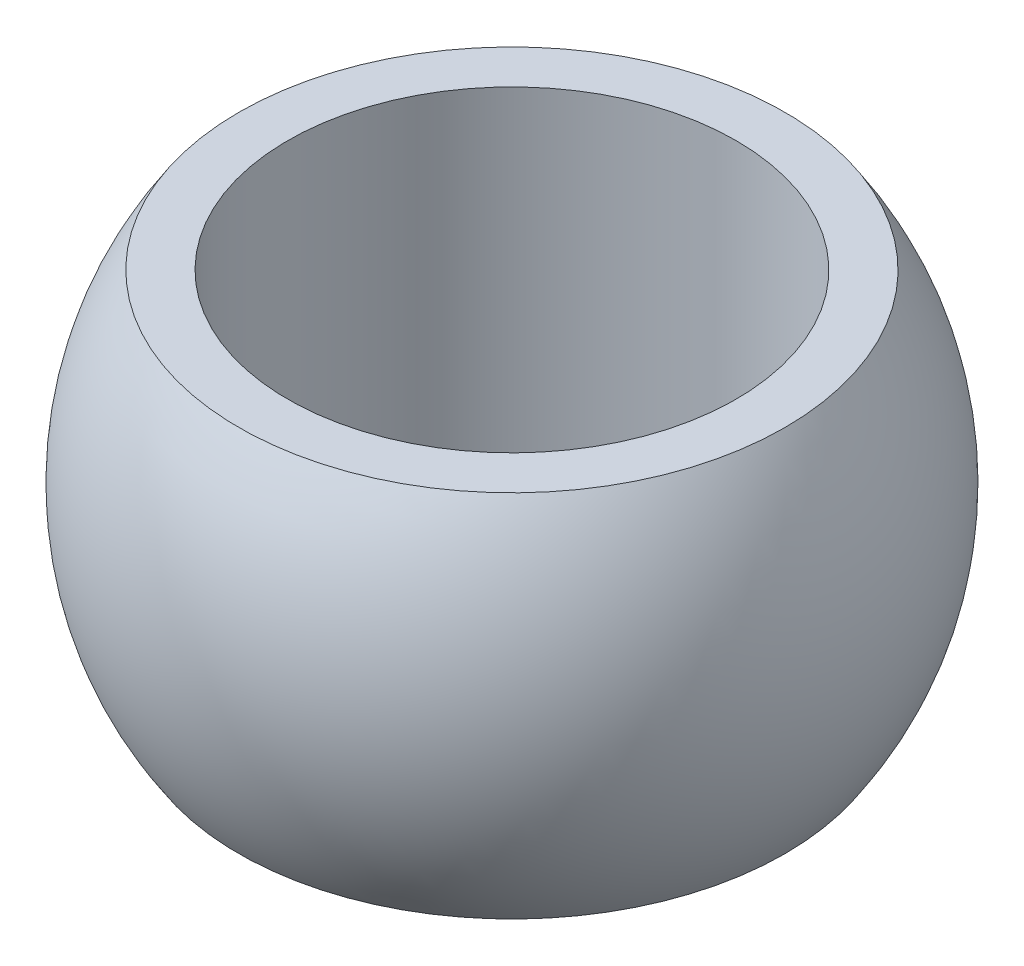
from build123d import *


with BuildPart() as part:
    # Esquisse1 → R_volution1 (revolve)
    with BuildSketch(Plane.XY, mode=Mode.PRIVATE) as r_volution1_sk:
        with BuildLine():
            Line((8.5, -7), (10.356157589, -7))
            ThreePointArc((10.356157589, -7), (12.5, 0), (10.356157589, 7))
            Line((10.356157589, 7), (8.5, 7))
            Line((8.5, 7), (8.5, -7))
        make_face()
    revolve(r_volution1_sk.sketch.rotate(Axis((0, -15.339775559, 0), (0, 1, 0)), 90), axis=Axis((0, -15.339775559, 0), (0, 1, 0)))


solid = part.part
